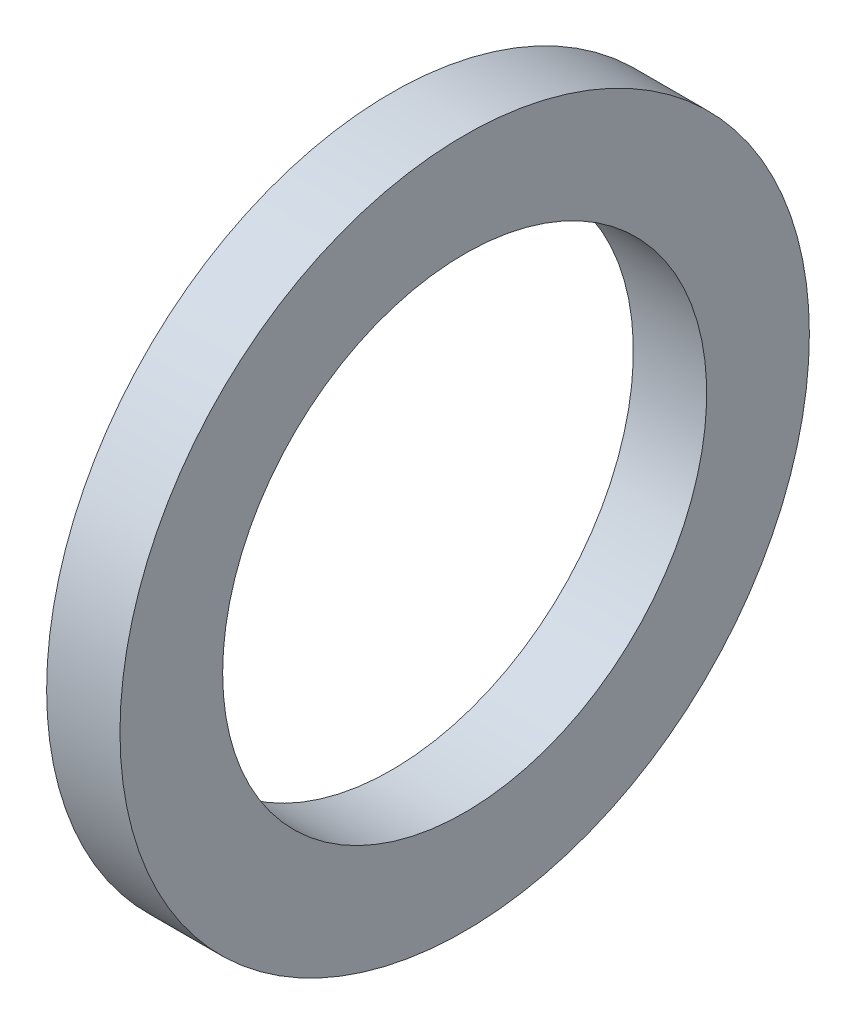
from build123d import *

# Parameters (mm, degrees)
SKETCH1_W = 5
SKETCH1_H = 7


with BuildPart() as part:
    # Sketch1 → Base-Revolve (revolve)
    with BuildSketch(Plane.XY, mode=Mode.PRIVATE) as base_revolve_sk:
        with Locations((-2.5, 20)):
            Rectangle(SKETCH1_W, SKETCH1_H)
    revolve(base_revolve_sk.sketch.rotate(Axis((-34.925, 0, 0), (1, 0, 0)), 90), axis=Axis((-34.925, 0, 0), (1, 0, 0)))


solid = part.part
